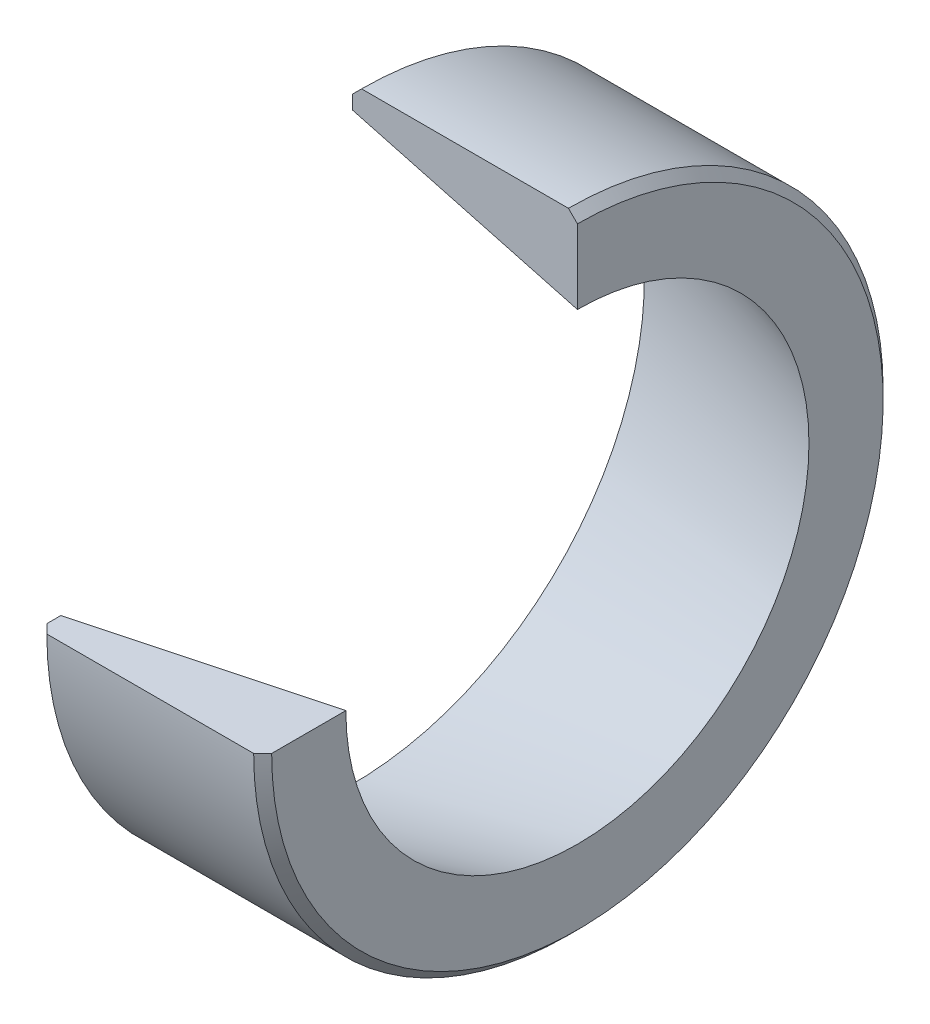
from build123d import *

# Parameters (mm, degrees)
COUPE_REACH     = 13.091
CHANFREIN1_SIZE = 0.2


with BuildPart() as part:
    # Esquisse1 → Base-R_volution (revolve)
    with BuildSketch(Plane.XY, mode=Mode.PRIVATE) as base_r_volution_sk:
        Polygon((0, 7), (0, 6.489745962), (5, 5.15), (5, 7), align=None)
    revolve(base_r_volution_sk.sketch.rotate(Axis((-7.043697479, 0, 0), (1, 0, 0)), 90), axis=Axis((-7.043697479, 0, 0), (1, 0, 0)))

    # Esquisse2 → COUPE (cut, up to next)
    with BuildSketch(Plane(origin=(5, 0, 0), x_dir=(0, 0, -1), z_dir=(1, 0, 0)), mode=Mode.PRIVATE) as coupe_sk1:
        with BuildLine():
            Line((0, 0), (0, 7))
            ThreePointArc((0, 7), (-4.949747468, 4.949747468), (-7, 0))
            Line((-7, 0), (0, 0))
        make_face()
    coupe_tool1 = extrude(coupe_sk1.sketch, amount=-COUPE_REACH, mode=Mode.PRIVATE) & part.part
    add(coupe_tool1.solids().sort_by_distance((5, 2.970892, 2.970892))[0], mode=Mode.SUBTRACT)

    # Chanfrein1
    chanfrein1_edges = [part.edges().sort_by_distance(p)[0] for p in [
        (5, -4.949747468, -4.949747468),
        (0, -4.949747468, -4.949747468),
    ]]
    chamfer(chanfrein1_edges, length=CHANFREIN1_SIZE)


solid = part.part
